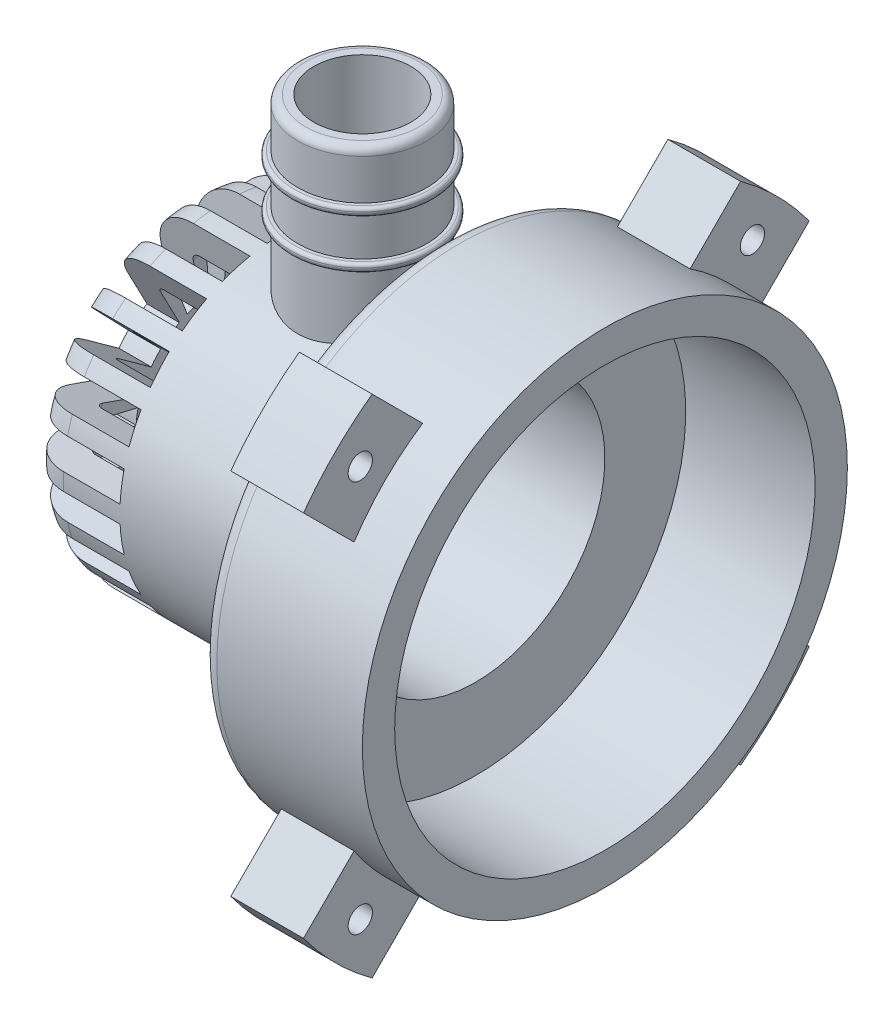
from build123d import *
from build123d.topology import SkipClean

# Parameters (mm, degrees)
ESQUISSE6_R                       = 15
EXTRUSION6_DEPTH                  = 10
CONG_1_R                          = 1
ESQUISSE7_R                       = 10
EXTRUSION7_DEPTH                  = 16
CONG_2_R                          = 2.5
COQUE1_T                          = -2
ENL_V_MAT_EXTRU_1_DEPTH           = 6
R_P_TITION_CIRCULAIRE1_COUNT      = 22
ESQUISSE10_R                      = 0.75
ENL_V_MAT_EXTRU_2_DEPTH           = 5
ESQUISSE11_R                      = 4
ESQUISSE11_R_2                    = 3
EXTRUSION8_DEPTH                  = 10
EXTRUSION8_DIRECTION_2_REACH      = 41.064
EXTRUSION8_DIRECTION_2_END_RADIUS = 10
ESQUISSE12_R                      = 3
ENL_V_MAT_EXTRU_3_DEPTH           = 15
CONG_3_R                          = 0.5
ESQUISSE13_R                      = 4.4
ESQUISSE13_R_2                    = 3
EXTRUSION9_DEPTH                  = 0.5
CONG_4_R                          = 0.2
R_P_TITION_LIN_AIRE1_COUNT        = 2
R_P_TITION_LIN_AIRE1_PITCH        = 3
CONG_4_OF_R_P_TITION_LIN_AIRE1_R  = 0.2
EXTRUSION10_DEPTH                 = 4.5
ESQUISSE15_R                      = 1.4
ENL_V_MAT_EXTRU_4_DEPTH           = 1
ESQUISSE16_R                      = 0.75
ENL_V_MAT_EXTRU_5_DEPTH           = 33.012643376
R_P_TITION_CIRCULAIRE3_COUNT      = 4


with BuildPart() as part:
    # Esquisse6 → Extrusion6 (new body)
    with BuildSketch(Plane.ZY):
        Circle(ESQUISSE6_R)
    extrude(amount=EXTRUSION6_DEPTH)

    # Cong_1
    cong_1_edges = [part.edges().sort_by_distance(p)[0] for p in [
        (-10, 0, -15),
    ]]
    fillet(cong_1_edges, radius=CONG_1_R)

    # Esquisse7 → Extrusion7 (add)
    with BuildSketch(Plane.ZY.offset(10)):
        Circle(ESQUISSE7_R)
    extrude(amount=EXTRUSION7_DEPTH)

    # Cong_2
    cong_2_edges = [part.edges().sort_by_distance(p)[0] for p in [
        (-26, 0, -10),
    ]]
    fillet(cong_2_edges, radius=CONG_2_R)

    # Coque1
    coque1_openings = [part.faces().sort_by_distance(p)[0] for p in [
        (0, 0, 0),
    ]]
    offset(amount=COQUE1_T, openings=coque1_openings, kind=Kind.INTERSECTION)

    # Esquisse9 → Enl_v. mat.-Extru.1 (cut)
    with BuildSketch(Plane.ZY.offset(26)):
        with BuildLine():
            Line((-1, 11.153325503), (1, 11.153325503))
            Line((1, 11.153325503), (0.446505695, 4.98002336))
            ThreePointArc((0.446505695, 4.98002336), (0, 5), (-0.446505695, 4.98002336))
            Line((-0.446505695, 4.98002336), (-1, 11.153325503))
        make_face()
    enl_v_mat_extru_1 = extrude(amount=-ENL_V_MAT_EXTRU_1_DEPTH, mode=Mode.SUBTRACT)

    # R_p_tition circulaire1: Enl_v. mat.-Extru.1 ×22 about axis
    r_p_tition_circulaire1_axis = Axis((0, 0, 0), (1, 0, 0))
    for i in range(1, R_P_TITION_CIRCULAIRE1_COUNT):
        add(enl_v_mat_extru_1.rotate(r_p_tition_circulaire1_axis, i * 360 / R_P_TITION_CIRCULAIRE1_COUNT), mode=Mode.SUBTRACT)

    # Esquisse10 → Enl_v. mat.-Extru.2 (cut)
    with BuildSketch(Plane.ZY.offset(26)):
        Circle(ESQUISSE10_R)
    extrude(amount=-ENL_V_MAT_EXTRU_2_DEPTH, mode=Mode.SUBTRACT)

    # Esquisse11 → Extrusion8 (add)
    with BuildSketch(Plane(origin=(0, 10, 0), x_dir=(-1, 0, 0), z_dir=(0, 1, 0))):
        with Locations(Location((15, 0, 0), (0, 0, 270))):
            Circle(ESQUISSE11_R)
        with Locations(Location((15, 0, 0), (0, 0, 90))):
            Circle(ESQUISSE11_R_2, mode=Mode.SUBTRACT)
    extrude(amount=EXTRUSION8_DEPTH)

    # Extrusion8 direction 2: up to this cylinder (the profile starts outside it)
    with SkipClean():  # the faces are left unmerged after this step: merging them gives an invalid solid
        extrusion8_direction_2_end = Plane(origin=(-15, 0, 0), z_dir=(1, 0, 0)) * Cylinder(EXTRUSION8_DIRECTION_2_END_RADIUS, 103.128, mode=Mode.PRIVATE)
        # Esquisse11 → Extrusion8 direction 2 (add, up to the surface)
        with BuildSketch(Plane(origin=(0, 10, 0), x_dir=(-1, 0, 0), z_dir=(0, 1, 0)), mode=Mode.PRIVATE) as extrusion8_direction_2_sk1:
            with Locations(Location((15, 0, 0), (0, 0, 270))):
                Circle(ESQUISSE11_R)
            with Locations(Location((15, 0, 0), (0, 0, 90))):
                Circle(ESQUISSE11_R_2, mode=Mode.SUBTRACT)
        extrusion8_direction_2_tool1 = extrude(extrusion8_direction_2_sk1.sketch, amount=-EXTRUSION8_DIRECTION_2_REACH, mode=Mode.PRIVATE) - extrusion8_direction_2_end
        add(extrusion8_direction_2_tool1.solids().sort_by_distance((-15, 10, 3.886863))[0])
        add(extrusion8_direction_2_tool1.solids().sort_by_distance((-15, 10, 3.886863))[1])

    # Esquisse12 → Enl_v. mat.-Extru.3 (cut)
    with BuildSketch(Plane(origin=(0, 10, 0), x_dir=(-1, 0, 0), z_dir=(0, 1, 0))):
        with Locations(Location((15, 0, 0), (0, 0, 90))):
            Circle(ESQUISSE12_R)
    extrude(amount=-ENL_V_MAT_EXTRU_3_DEPTH, mode=Mode.SUBTRACT)

    # Cong_3
    cong_3_edges = [part.edges().sort_by_distance(p)[0] for p in [
        (-15, 20, 4),
    ]]
    fillet(cong_3_edges, radius=CONG_3_R)

    # Esquisse13 → Extrusion9 (add)
    with BuildSketch(Plane(origin=(0, 17, 0), x_dir=(-1, 0, 0), z_dir=(0, 1, 0))):
        with Locations(Location((15, 0, 0), (0, 0, 90))):
            Circle(ESQUISSE13_R)
        with Locations(Location((15, 0, 0), (0, 0, 90))):
            Circle(ESQUISSE13_R_2, mode=Mode.SUBTRACT)
    extrusion9 = extrude(amount=-EXTRUSION9_DEPTH)

    # Cong_4
    cong_4_edges = [part.edges().sort_by_distance(p)[0] for p in [
        (-15, 17, -4.4),
        (-15, 16.5, -4.4),
    ]]
    fillet(cong_4_edges, radius=CONG_4_R)

    # R_p_tition lin_aire1: Extrusion9 ×2
    with Locations(*[(0, -i * R_P_TITION_LIN_AIRE1_PITCH, 0) for i in range(1, R_P_TITION_LIN_AIRE1_COUNT)]):
        add(extrusion9)

    # Cong_4 of R_p_tition lin_aire1
    cong_4_of_r_p_tition_lin_aire1_edges = [part.edges().sort_by_distance(p)[0] for p in [
        (-15, 14, -4.4),
        (-15, 13.5, -4.4),
    ]]
    fillet(cong_4_of_r_p_tition_lin_aire1_edges, radius=CONG_4_OF_R_P_TITION_LIN_AIRE1_R)

    # Esquisse14 → Extrusion10 (add)
    with BuildSketch(Plane(origin=(-3, 0, 0), x_dir=(0, 0, -1), z_dir=(1, 0, 0))):
        with BuildLine():
            Line((12.513625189, 8.270984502), (15.638392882, 11.395752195))
            ThreePointArc((15.638392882, 11.395752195), (13.682516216, 13.682516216), (11.395752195, 15.638392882))
            Line((11.395752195, 15.638392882), (8.270984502, 12.513625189))
            ThreePointArc((8.270984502, 12.513625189), (10.606601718, 10.606601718), (12.513625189, 8.270984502))
        make_face()
    extrusion10 = extrude(amount=-EXTRUSION10_DEPTH)

    # Esquisse15 → Enl_v. mat.-Extru.4 (cut)
    with BuildSketch(Plane.ZY.offset(7.5)):
        with Locations((-12.126881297, 12.126881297)):
            Circle(ESQUISSE15_R)
    enl_v_mat_extru_4 = extrude(amount=-ENL_V_MAT_EXTRU_4_DEPTH, mode=Mode.SUBTRACT)

    # Esquisse16 → Enl_v. mat.-Extru.5 (cut, through all)
    with BuildSketch(Plane.ZY.offset(6.5)):
        with Locations((-12.126881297, 12.126881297)):
            Circle(ESQUISSE16_R)
    enl_v_mat_extru_5 = extrude(amount=-ENL_V_MAT_EXTRU_5_DEPTH, mode=Mode.SUBTRACT)

    # R_p_tition circulaire3: Extrusion10, Enl_v. mat.-Extru.4, Enl_v. mat.-Extru.5 ×4 about axis
    r_p_tition_circulaire3_axis = Axis((0, 0, 0), (1, 0, 0))
    add([extrusion10.rotate(r_p_tition_circulaire3_axis, i * 360 / R_P_TITION_CIRCULAIRE3_COUNT) for i in range(1, R_P_TITION_CIRCULAIRE3_COUNT)])
    add([enl_v_mat_extru_4.rotate(r_p_tition_circulaire3_axis, i * 360 / R_P_TITION_CIRCULAIRE3_COUNT) for i in range(1, R_P_TITION_CIRCULAIRE3_COUNT)], mode=Mode.SUBTRACT)
    add([enl_v_mat_extru_5.rotate(r_p_tition_circulaire3_axis, i * 360 / R_P_TITION_CIRCULAIRE3_COUNT) for i in range(1, R_P_TITION_CIRCULAIRE3_COUNT)], mode=Mode.SUBTRACT)


solid = part.part
